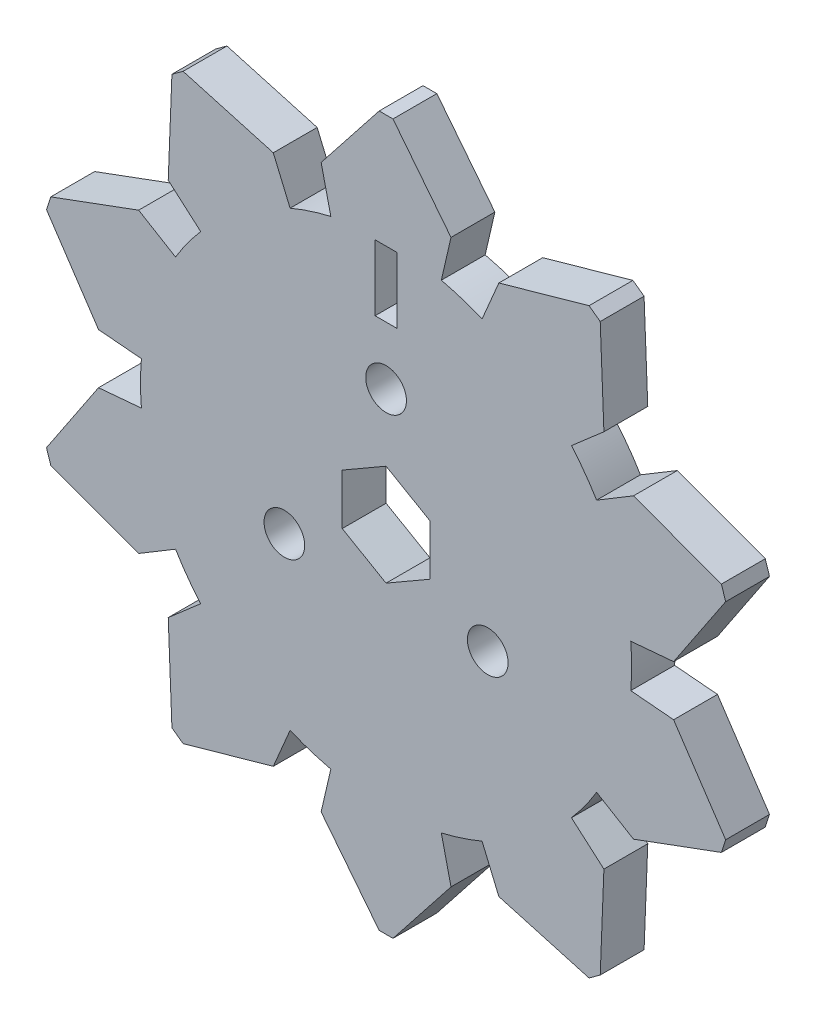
from build123d import *

# Parameters (mm, degrees)
BOSS_EXTRUDE1_DEPTH   = 3.175
F_4_CLEARANCE_HOLE1_D = 2.9464
SKETCH4_W             = 1.5875
SKETCH4_H             = 4.7625
CUT_EXTRUDE1_DEPTH    = 36.696223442


with BuildPart() as part:
    # Sketch1 → Boss-Extrude1 (new body)
    with BuildSketch(Plane.XY):
        with BuildLine():
            Line((-3.999629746, 17.324299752), (-4.70036767, 20.359529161))
            Line((-4.70036767, 20.359529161), (-0.5, 25.686287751))
            Line((-0.5, 25.686287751), (0.5, 25.686287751))
            Line((0.5, 25.686287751), (4.70036767, 20.359529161))
            Line((4.70036767, 20.359529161), (3.999629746, 17.324299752))
            ThreePointArc((3.999629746, 17.324299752), (5.49432216, 16.90978486), (6.947199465, 16.366576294))
            Line((6.947199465, 16.366576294), (8.16435366, 19.234011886))
            Line((8.16435366, 19.234011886), (14.693512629, 21.074535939))
            Line((14.693512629, 21.074535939), (15.502529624, 20.486750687))
            Line((15.502529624, 20.486750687), (15.769708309, 13.708398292))
            Line((15.769708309, 13.708398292), (13.418736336, 11.664729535))
            ThreePointArc((13.418736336, 11.664729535), (14.38432216, 10.450821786), (15.240434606, 9.157376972))
            Line((15.240434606, 9.157376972), (17.910569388, 10.76175581))
            Line((17.910569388, 10.76175581), (24.274602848, 8.413027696))
            Line((24.274602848, 8.413027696), (24.583619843, 7.461971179))
            Line((24.583619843, 7.461971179), (20.815556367, 1.821125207))
            Line((20.815556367, 1.821125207), (17.712341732, 1.549629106))
            ThreePointArc((17.712341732, 1.549629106), (17.78, 0), (17.712341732, -1.549629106))
            Line((17.712341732, -1.549629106), (20.815556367, -1.821125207))
            Line((20.815556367, -1.821125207), (24.583619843, -7.461971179))
            Line((24.583619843, -7.461971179), (24.274602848, -8.413027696))
            Line((24.274602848, -8.413027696), (17.910569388, -10.76175581))
            Line((17.910569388, -10.76175581), (15.240434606, -9.157376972))
            ThreePointArc((15.240434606, -9.157376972), (14.38432216, -10.450821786), (13.418736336, -11.664729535))
            Line((13.418736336, -11.664729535), (15.769708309, -13.708398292))
            Line((15.769708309, -13.708398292), (15.502529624, -20.486750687))
            Line((15.502529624, -20.486750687), (14.693512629, -21.074535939))
            Line((14.693512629, -21.074535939), (8.16435366, -19.234011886))
            Line((8.16435366, -19.234011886), (6.947199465, -16.366576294))
            ThreePointArc((6.947199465, -16.366576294), (5.49432216, -16.90978486), (3.999629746, -17.324299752))
            Line((3.999629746, -17.324299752), (4.70036767, -20.359529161))
            Line((4.70036767, -20.359529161), (0.5, -25.686287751))
            Line((0.5, -25.686287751), (-0.5, -25.686287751))
            Line((-0.5, -25.686287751), (-4.70036767, -20.359529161))
            Line((-4.70036767, -20.359529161), (-3.999629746, -17.324299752))
            ThreePointArc((-3.999629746, -17.324299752), (-5.49432216, -16.90978486), (-6.947199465, -16.366576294))
            Line((-6.947199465, -16.366576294), (-8.16435366, -19.234011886))
            Line((-8.16435366, -19.234011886), (-14.693512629, -21.074535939))
            Line((-14.693512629, -21.074535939), (-15.502529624, -20.486750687))
            Line((-15.502529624, -20.486750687), (-15.769708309, -13.708398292))
            Line((-15.769708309, -13.708398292), (-13.418736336, -11.664729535))
            ThreePointArc((-13.418736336, -11.664729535), (-14.38432216, -10.450821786), (-15.240434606, -9.157376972))
            Line((-15.240434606, -9.157376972), (-17.910569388, -10.76175581))
            Line((-17.910569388, -10.76175581), (-24.274602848, -8.413027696))
            Line((-24.274602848, -8.413027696), (-24.583619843, -7.461971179))
            Line((-24.583619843, -7.461971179), (-20.815556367, -1.821125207))
            Line((-20.815556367, -1.821125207), (-17.712341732, -1.549629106))
            ThreePointArc((-17.712341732, -1.549629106), (-17.78, 0), (-17.712341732, 1.549629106))
            Line((-17.712341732, 1.549629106), (-20.815556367, 1.821125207))
            Line((-20.815556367, 1.821125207), (-24.583619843, 7.461971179))
            Line((-24.583619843, 7.461971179), (-24.274602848, 8.413027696))
            Line((-24.274602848, 8.413027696), (-17.910569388, 10.76175581))
            Line((-17.910569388, 10.76175581), (-15.240434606, 9.157376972))
            ThreePointArc((-15.240434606, 9.157376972), (-14.38432216, 10.450821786), (-13.418736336, 11.664729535))
            Line((-13.418736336, 11.664729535), (-15.769708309, 13.708398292))
            Line((-15.769708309, 13.708398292), (-15.502529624, 20.486750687))
            Line((-15.502529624, 20.486750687), (-14.693512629, 21.074535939))
            Line((-14.693512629, 21.074535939), (-8.16435366, 19.234011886))
            Line((-8.16435366, 19.234011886), (-6.947199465, 16.366576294))
            ThreePointArc((-6.947199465, 16.366576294), (-5.49432216, 16.90978486), (-3.999629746, 17.324299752))
        make_face()
        Polygon((3.175, 1.833087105), (0, 3.666174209), (-3.175, 1.833087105), (-3.175, -1.833087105), (0, -3.666174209), (3.175, -1.833087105), align=None, mode=Mode.SUBTRACT)
    extrude(amount=BOSS_EXTRUDE1_DEPTH)

    # 4 Clearance Hole1 (through all)
    with Locations(Plane.XY.offset(3.175)):
        with Locations((0, 8.5), (7.361215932, -4.25), (-7.361215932, -4.25)):
            Hole(F_4_CLEARANCE_HOLE1_D / 2)

    # Sketch4 → Cut-Extrude1 (cut, through all)
    with BuildSketch(Plane.XY.offset(3.175)):
        with Locations((0, 15.08125)):
            Rectangle(SKETCH4_W, SKETCH4_H)
    extrude(amount=-CUT_EXTRUDE1_DEPTH, mode=Mode.SUBTRACT)


solid = part.part
